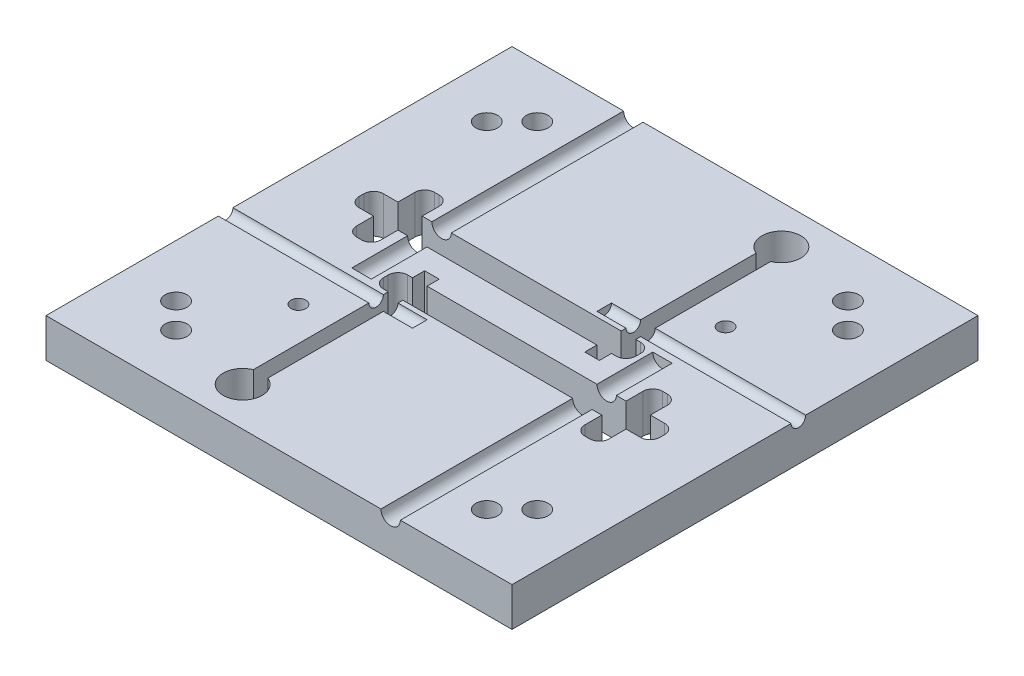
from build123d import *

# Parameters (mm, degrees)
SKETCH1_W           = 304.8
SKETCH1_H           = 304.8
EXTRUDE1_DEPTH      = 12.7
SKETCH2_R           = 7.1374
CUT_EXTRUDE1_DEPTH  = 218.017695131
SKETCH3_W           = 15.875
SKETCH3_H           = 50.8
CUT_EXTRUDE2_DEPTH  = 218.017695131
FILLET1_R           = 6.35
FILLET2_R           = 6.35
FILLET3_R           = 6.35
FILLET4_R           = 6.35
SKETCH5_W           = 79.375
SKETCH5_H           = 15.875
CUT_EXTRUDE4_DEPTH  = 218.017695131
FILLET5_R           = 6.35
FILLET6_R           = 6.35
FILLET7_R           = 6.35
FILLET8_R           = 6.35
SKETCH6_W           = 128.5875
SKETCH6_H           = 15.875
CUT_EXTRUDE5_DEPTH  = 218.017695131
SKETCH7_R           = 4.7625
CUT_EXTRUDE6_DEPTH  = 127
FILLET9_R           = 6.35
FILLET10_R          = 6.35
CUT_EXTRUDE9_START  = 12.7
SKETCH8_W           = 9.525
SKETCH8_H           = 127
CUT_EXTRUDE9_DEPTH  = 230.717695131
SKETCH9_R           = 12.7
CUT_EXTRUDE10_DEPTH = 218.017695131
SKETCH10_R          = 6.35
CUT_EXTRUDE11_DEPTH = 177.8
SKETCH11_R          = 6.35
CUT_EXTRUDE12_DEPTH = 177.8
SKETCH12_W          = 15.875
SKETCH12_H          = 50.8
CUT_EXTRUDE13_DEPTH = 218.017695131
FILLET11_R          = 6.35
FILLET12_R          = 6.35
FILLET13_R          = 6.35
FILLET14_R          = 6.35
SKETCH13_W          = 79.248
SKETCH13_H          = 15.875
CUT_EXTRUDE14_DEPTH = 218.017695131
FILLET15_R          = 6.35
FILLET16_R          = 6.35
FILLET17_R          = 6.35
FILLET18_R          = 6.35
SKETCH14_W          = 114.79345596
SKETCH14_H          = 15.875
CUT_EXTRUDE15_DEPTH = 218.017695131
FILLET19_R          = 6.35
FILLET20_R          = 6.35
SKETCH15_R          = 4.7625
CUT_EXTRUDE16_DEPTH = 127
SKETCH16_W          = 9.525
SKETCH16_H          = 127
CUT_EXTRUDE17_DEPTH = 218.017695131
SKETCH17_R          = 12.7
CUT_EXTRUDE18_DEPTH = 218.017695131
SKETCH18_R          = 4.826
CUT_EXTRUDE19_DEPTH = 218.017695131


with BuildPart() as part:
    # Sketch1 → Extrude1 (new, symmetric)
    with BuildSketch(Plane(origin=(0, 0, 0), x_dir=(1, 0, 0), z_dir=(0, 1, 0))):
        Rectangle(SKETCH1_W, SKETCH1_H)
    extrude(amount=EXTRUDE1_DEPTH, both=True)

    # Sketch2 → Cut-Extrude1 (cut, through all)
    with BuildSketch(Plane(origin=(0, 12.7, 0), x_dir=(-1, 0, 0), z_dir=(0, 1, 0))):
        with Locations(Location((118.11, -101.6, 0), (0, 0, 90))):
            Circle(SKETCH2_R)
        with Locations(Location((-118.11, -101.6, 0), (0, 0, 90))):
            Circle(SKETCH2_R)
        with Locations(Location((-101.6, -118.11, 0), (0, 0, 90))):
            Circle(SKETCH2_R)
        with Locations(Location((101.6, -118.11, 0), (0, 0, 90))):
            Circle(SKETCH2_R)
    cut_extrude1 = extrude(amount=-CUT_EXTRUDE1_DEPTH, mode=Mode.SUBTRACT)

    # Mirror1: Cut-Extrude1 across plane
    add(cut_extrude1.mirror(Plane.XY), mode=Mode.SUBTRACT)

    # Sketch3 → Cut-Extrude2 (cut, through all)
    with BuildSketch(Plane(origin=(0, 12.7, 0), x_dir=(-1, 0, 0), z_dir=(0, 1, 0))):
        with Locations((93.6625, -19.05)):
            Rectangle(SKETCH3_W, SKETCH3_H)
    extrude(amount=-CUT_EXTRUDE2_DEPTH, mode=Mode.SUBTRACT)

    # Fillet1
    fillet1_edges = [part.edges().sort_by_distance(p)[0] for p in [
        (-101.6, 0, -44.45),
    ]]
    fillet(fillet1_edges, radius=FILLET1_R)

    # Fillet2
    fillet2_edges = [part.edges().sort_by_distance(p)[0] for p in [
        (-85.725, 0, -44.45),
    ]]
    fillet(fillet2_edges, radius=FILLET2_R)

    # Fillet3
    fillet3_edges = [part.edges().sort_by_distance(p)[0] for p in [
        (-101.6, 0, 6.35),
    ]]
    fillet(fillet3_edges, radius=FILLET3_R)

    # Fillet4
    fillet4_edges = [part.edges().sort_by_distance(p)[0] for p in [
        (-85.725, 0, 6.35),
    ]]
    fillet(fillet4_edges, radius=FILLET4_R)

    # Sketch5 → Cut-Extrude4 (cut, through all)
    with BuildSketch(Plane(origin=(0, 12.7, 0), x_dir=(-1, 0, 0), z_dir=(0, 1, 0))):
        with Locations((77.7875, -19.0373)):
            Rectangle(SKETCH5_W, SKETCH5_H)
    extrude(amount=-CUT_EXTRUDE4_DEPTH, mode=Mode.SUBTRACT)

    # Fillet5
    fillet5_edges = [part.edges().sort_by_distance(p)[0] for p in [
        (-117.475, 0, -26.9748),
    ]]
    fillet(fillet5_edges, radius=FILLET5_R)

    # Fillet6
    fillet6_edges = [part.edges().sort_by_distance(p)[0] for p in [
        (-117.475, 0, -11.0998),
    ]]
    fillet(fillet6_edges, radius=FILLET6_R)

    # Fillet7
    fillet7_edges = [part.edges().sort_by_distance(p)[0] for p in [
        (-38.1, 0, -26.9748),
    ]]
    fillet(fillet7_edges, radius=FILLET7_R)

    # Fillet8
    fillet8_edges = [part.edges().sort_by_distance(p)[0] for p in [
        (-38.1, 0, -11.0998),
    ]]
    fillet(fillet8_edges, radius=FILLET8_R)

    # Sketch6 → Cut-Extrude5 (cut, through all)
    with BuildSketch(Plane(origin=(0, 12.7, 0), x_dir=(-1, 0, 0), z_dir=(0, 1, 0))):
        with Locations((0.79375, -19.0373)):
            Rectangle(SKETCH6_W, SKETCH6_H)
    extrude(amount=-CUT_EXTRUDE5_DEPTH, mode=Mode.SUBTRACT)

    # Sketch7 → Cut-Extrude6 (cut)
    with BuildSketch(Plane(origin=(152.4, 0, 0), x_dir=(0, 0, -1), z_dir=(1, 0, 0))):
        with Locations((34.925, 12.7)):
            Circle(SKETCH7_R)
    extrude(amount=-CUT_EXTRUDE6_DEPTH, mode=Mode.SUBTRACT)

    # Fillet9
    fillet9_edges = [part.edges().sort_by_distance(p)[0] for p in [
        (63.5, 0, -26.9748),
    ]]
    fillet(fillet9_edges, radius=FILLET9_R)

    # Fillet10
    fillet10_edges = [part.edges().sort_by_distance(p)[0] for p in [
        (63.5, 0, -11.0998),
    ]]
    fillet(fillet10_edges, radius=FILLET10_R)

    # Sketch8 → Cut-Extrude9 (cut, through all)
    with BuildSketch(Plane(origin=(0, 12.7, 0), x_dir=(-1, 0, 0), z_dir=(0, 1, 0)).offset(CUT_EXTRUDE9_START)):
        with Locations((-49.2125, -66.675)):
            Rectangle(SKETCH8_W, SKETCH8_H)
    extrude(amount=-CUT_EXTRUDE9_DEPTH, mode=Mode.SUBTRACT)

    # Sketch9 → Cut-Extrude10 (cut, through all)
    with BuildSketch(Plane(origin=(0, 12.7, 0), x_dir=(-1, 0, 0), z_dir=(0, 1, 0))):
        with Locations((-49.1998, -127)):
            Circle(SKETCH9_R)
    extrude(amount=-CUT_EXTRUDE10_DEPTH, mode=Mode.SUBTRACT)

    # Sketch10 → Cut-Extrude11 (cut)
    with BuildSketch(Plane(origin=(0, 0, -152.4), x_dir=(-1, 0, 0), z_dir=(0, 0, -1))):
        with Locations((73.025, 12.7)):
            Circle(SKETCH10_R)
    extrude(amount=-CUT_EXTRUDE11_DEPTH, mode=Mode.SUBTRACT)

    # Sketch11 → Cut-Extrude12 (cut)
    with BuildSketch(Plane.XY.offset(152.4)):
        with Locations((73.025, 12.7)):
            Circle(SKETCH11_R)
    extrude(amount=-CUT_EXTRUDE12_DEPTH, mode=Mode.SUBTRACT)

    # Sketch12 → Cut-Extrude13 (cut, through all)
    with BuildSketch(Plane(origin=(0, 12.7, 0), x_dir=(-1, 0, 0), z_dir=(0, 1, 0))):
        with Locations((-93.6625, 19.05)):
            Rectangle(SKETCH12_W, SKETCH12_H)
    extrude(amount=-CUT_EXTRUDE13_DEPTH, mode=Mode.SUBTRACT)

    # Fillet11
    fillet11_edges = [part.edges().sort_by_distance(p)[0] for p in [
        (85.725, 0, -6.35),
    ]]
    fillet(fillet11_edges, radius=FILLET11_R)

    # Fillet12
    fillet12_edges = [part.edges().sort_by_distance(p)[0] for p in [
        (101.6, 0, -6.35),
    ]]
    fillet(fillet12_edges, radius=FILLET12_R)

    # Fillet13
    fillet13_edges = [part.edges().sort_by_distance(p)[0] for p in [
        (101.6, 0, 44.45),
    ]]
    fillet(fillet13_edges, radius=FILLET13_R)

    # Fillet14
    fillet14_edges = [part.edges().sort_by_distance(p)[0] for p in [
        (85.725, 0, 44.45),
    ]]
    fillet(fillet14_edges, radius=FILLET14_R)

    # Sketch13 → Cut-Extrude14 (cut, through all)
    with BuildSketch(Plane(origin=(0, 12.7, 0), x_dir=(-1, 0, 0), z_dir=(0, 1, 0))):
        with Locations((-77.724, 19.0373)):
            Rectangle(SKETCH13_W, SKETCH13_H)
    extrude(amount=-CUT_EXTRUDE14_DEPTH, mode=Mode.SUBTRACT)

    # Fillet15
    fillet15_edges = [part.edges().sort_by_distance(p)[0] for p in [
        (117.348, 0, 11.0998),
    ]]
    fillet(fillet15_edges, radius=FILLET15_R)

    # Fillet16
    fillet16_edges = [part.edges().sort_by_distance(p)[0] for p in [
        (117.348, 0, 26.9748),
    ]]
    fillet(fillet16_edges, radius=FILLET16_R)

    # Fillet17
    fillet17_edges = [part.edges().sort_by_distance(p)[0] for p in [
        (38.1, 0, 26.9748),
    ]]
    fillet(fillet17_edges, radius=FILLET17_R)

    # Fillet18
    fillet18_edges = [part.edges().sort_by_distance(p)[0] for p in [
        (38.1, 0, 11.0998),
    ]]
    fillet(fillet18_edges, radius=FILLET18_R)

    # Sketch14 → Cut-Extrude15 (cut, through all)
    with BuildSketch(Plane(origin=(0, 12.7, 0), x_dir=(-1, 0, 0), z_dir=(0, 1, 0))):
        with Locations((6.10327202, 19.0373)):
            Rectangle(SKETCH14_W, SKETCH14_H)
    extrude(amount=-CUT_EXTRUDE15_DEPTH, mode=Mode.SUBTRACT)

    # Fillet19
    fillet19_edges = [part.edges().sort_by_distance(p)[0] for p in [
        (-63.5, 0, 11.0998),
    ]]
    fillet(fillet19_edges, radius=FILLET19_R)

    # Fillet20
    fillet20_edges = [part.edges().sort_by_distance(p)[0] for p in [
        (-63.5, 0, 26.9748),
    ]]
    fillet(fillet20_edges, radius=FILLET20_R)

    # Sketch15 → Cut-Extrude16 (cut)
    with BuildSketch(Plane.ZY.offset(152.4)):
        with Locations((34.925, 12.7)):
            Circle(SKETCH15_R)
    extrude(amount=-CUT_EXTRUDE16_DEPTH, mode=Mode.SUBTRACT)

    # Sketch16 → Cut-Extrude17 (cut, through all)
    with BuildSketch(Plane(origin=(0, 12.7, 0), x_dir=(-1, 0, 0), z_dir=(0, 1, 0))):
        with Locations((49.2125, 66.675)):
            Rectangle(SKETCH16_W, SKETCH16_H)
    extrude(amount=-CUT_EXTRUDE17_DEPTH, mode=Mode.SUBTRACT)

    # Sketch17 → Cut-Extrude18 (cut, through all)
    with BuildSketch(Plane(origin=(0, 12.7, 0), x_dir=(-1, 0, 0), z_dir=(0, 1, 0))):
        with Locations((49.1998, 127)):
            Circle(SKETCH17_R)
    extrude(amount=-CUT_EXTRUDE18_DEPTH, mode=Mode.SUBTRACT)

    # Sketch18 → Cut-Extrude19 (cut, through all)
    with BuildSketch(Plane(origin=(0, 12.7, 0), x_dir=(-1, 0, 0), z_dir=(0, 1, 0))):
        with Locations(Location((-76.2, -63.5, 0), (0, 0, 90))):
            Circle(SKETCH18_R)
        with Locations(Location((76.2, 63.5, 0), (0, 0, 90))):
            Circle(SKETCH18_R)
    extrude(amount=-CUT_EXTRUDE19_DEPTH, mode=Mode.SUBTRACT)


solid = part.part
